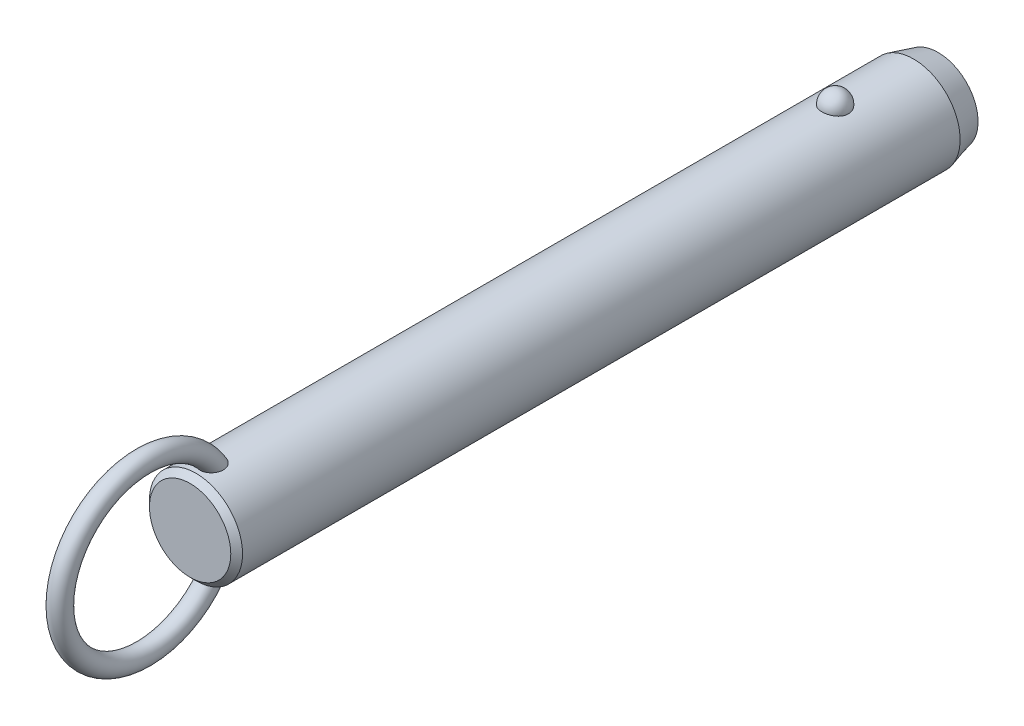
ISO-10303-21;
HEADER;
FILE_DESCRIPTION(('STEP AP214'),'2;1');
FILE_NAME('part.step','',(''),(''),'','','');
FILE_SCHEMA(('AUTOMOTIVE_DESIGN { 1 0 10303 214 1 1 1 1 }'));
ENDSEC;
DATA;
#1=APPLICATION_CONTEXT('core data for automotive mechanical design processes');
#2=APPLICATION_PROTOCOL_DEFINITION('international standard','automotive_design',2000,#1);
#3=PRODUCT_CONTEXT('',#1,'mechanical');
#4=PRODUCT('Part','Part','',(#3));
#5=PRODUCT_RELATED_PRODUCT_CATEGORY('part','',(#4));
#6=PRODUCT_DEFINITION_FORMATION('','',#4);
#7=PRODUCT_DEFINITION_CONTEXT('part definition',#1,'design');
#8=PRODUCT_DEFINITION('design','',#6,#7);
#9=PRODUCT_DEFINITION_SHAPE('','',#8);
#10=(LENGTH_UNIT() NAMED_UNIT(*) SI_UNIT(.MILLI.,.METRE.));
#11=(NAMED_UNIT(*) PLANE_ANGLE_UNIT() SI_UNIT($,.RADIAN.));
#12=(NAMED_UNIT(*) SI_UNIT($,.STERADIAN.) SOLID_ANGLE_UNIT());
#13=UNCERTAINTY_MEASURE_WITH_UNIT(LENGTH_MEASURE(1.E-05),#10,'distance_accuracy_value','');
#14=(GEOMETRIC_REPRESENTATION_CONTEXT(3) GLOBAL_UNCERTAINTY_ASSIGNED_CONTEXT((#13)) GLOBAL_UNIT_ASSIGNED_CONTEXT((#10,
#11,#12)) REPRESENTATION_CONTEXT('',''));
#15=CARTESIAN_POINT('',(0.,0.,0.));
#16=DIRECTION('',(0.,0.,1.));
#17=DIRECTION('',(1.,0.,0.));
#18=AXIS2_PLACEMENT_3D('',#15,#16,#17);
#19=CARTESIAN_POINT('',(0.,0.,119.4));
#20=DIRECTION('',(0.,0.,-1.));
#21=DIRECTION('',(-1.,0.,0.));
#22=AXIS2_PLACEMENT_3D('',#19,#20,#21);
#23=CYLINDRICAL_SURFACE('',#22,9.5);
#24=CARTESIAN_POINT('',(2.67259918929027,9.11631578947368,-2.70000000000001));
#25=CARTESIAN_POINT('',(2.6725968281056,9.11631786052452,-2.54909854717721));
#26=CARTESIAN_POINT('',(2.66030567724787,9.11994722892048,-2.39816735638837));
#27=CARTESIAN_POINT('',(2.6114347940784,9.13405924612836,-2.10058568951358));
#28=CARTESIAN_POINT('',(2.57484658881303,9.14454428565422,-1.95393672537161));
#29=CARTESIAN_POINT('',(2.47830875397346,9.17117631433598,-1.66916069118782));
#30=CARTESIAN_POINT('',(2.41836936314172,9.18732082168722,-1.53102991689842));
#31=CARTESIAN_POINT('',(2.27661331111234,9.22346780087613,-1.26705393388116));
#32=CARTESIAN_POINT('',(2.19479699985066,9.24347021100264,-1.14120852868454));
#33=CARTESIAN_POINT('',(2.01085282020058,9.28522401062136,-0.904632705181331));
#34=CARTESIAN_POINT('',(1.90862396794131,9.30698376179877,-0.793982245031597));
#35=CARTESIAN_POINT('',(1.6867437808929,9.34973971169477,-0.591607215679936));
#36=CARTESIAN_POINT('',(1.56709244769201,9.37073591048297,-0.499882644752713));
#37=CARTESIAN_POINT('',(1.31393976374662,9.40956370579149,-0.338167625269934));
#38=CARTESIAN_POINT('',(1.18048026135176,9.42740444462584,-0.268113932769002));
#39=CARTESIAN_POINT('',(0.903154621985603,9.45799906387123,-0.151390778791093));
#40=CARTESIAN_POINT('',(0.759289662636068,9.47075351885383,-0.104718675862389));
#41=CARTESIAN_POINT('',(0.468074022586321,9.48956256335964,-0.0367633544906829));
#42=CARTESIAN_POINT('',(0.320836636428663,9.49573643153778,-0.0150275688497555));
#43=CARTESIAN_POINT('',(0.0246714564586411,9.50112183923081,0.00396199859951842));
#44=CARTESIAN_POINT('',(-0.124256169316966,9.50033406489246,0.00121819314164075));
#45=CARTESIAN_POINT('',(-0.417264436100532,9.4919475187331,-0.0284441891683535));
#46=CARTESIAN_POINT('',(-0.56138413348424,9.48444885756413,-0.0550074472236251));
#47=CARTESIAN_POINT('',(-0.842986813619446,9.46357853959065,-0.131064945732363));
#48=CARTESIAN_POINT('',(-0.980469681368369,9.450206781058,-0.180559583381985));
#49=CARTESIAN_POINT('',(-1.24585005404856,9.41890822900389,-0.301476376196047));
#50=CARTESIAN_POINT('',(-1.37368611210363,9.40095498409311,-0.373026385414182));
#51=CARTESIAN_POINT('',(-1.61552738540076,9.36242964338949,-0.536025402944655));
#52=CARTESIAN_POINT('',(-1.72953116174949,9.34185727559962,-0.627476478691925));
#53=CARTESIAN_POINT('',(-1.9429225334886,9.29984568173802,-0.829844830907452));
#54=CARTESIAN_POINT('',(-2.04198021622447,9.27839736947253,-0.94110821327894));
#55=CARTESIAN_POINT('',(-2.22026460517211,9.23735994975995,-1.17883414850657));
#56=CARTESIAN_POINT('',(-2.29948985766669,9.21777097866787,-1.30529781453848));
#57=CARTESIAN_POINT('',(-2.43697287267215,9.18238994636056,-1.57158566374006));
#58=CARTESIAN_POINT('',(-2.49497068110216,9.16664569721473,-1.71155057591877));
#59=CARTESIAN_POINT('',(-2.5872073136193,9.14104303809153,-1.99961197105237));
#60=CARTESIAN_POINT('',(-2.62144683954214,9.13118445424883,-2.14770821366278));
#61=CARTESIAN_POINT('',(-2.66521466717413,9.11850622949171,-2.44715424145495));
#62=CARTESIAN_POINT('',(-2.67484831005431,9.11565658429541,-2.59848735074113));
#63=CARTESIAN_POINT('',(-2.66946735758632,9.11723375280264,-2.90067317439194));
#64=CARTESIAN_POINT('',(-2.65445345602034,9.12166036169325,-3.05152590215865));
#65=CARTESIAN_POINT('',(-2.60029711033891,9.13724422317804,-3.34766110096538));
#66=CARTESIAN_POINT('',(-2.56127978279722,9.14836656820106,-3.49296833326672));
#67=CARTESIAN_POINT('',(-2.46018844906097,9.17606676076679,-3.77477535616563));
#68=CARTESIAN_POINT('',(-2.39811349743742,9.1926448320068,-3.9112747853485));
#69=CARTESIAN_POINT('',(-2.25202303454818,9.22952198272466,-4.17244273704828));
#70=CARTESIAN_POINT('',(-2.16788714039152,9.24984129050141,-4.29704106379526));
#71=CARTESIAN_POINT('',(-1.9799408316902,9.29188255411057,-4.53013066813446));
#72=CARTESIAN_POINT('',(-1.87612963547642,9.31360456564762,-4.63862130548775));
#73=CARTESIAN_POINT('',(-1.65105429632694,9.35612959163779,-4.8369029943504));
#74=CARTESIAN_POINT('',(-1.52972405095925,9.37692871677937,-4.92661991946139));
#75=CARTESIAN_POINT('',(-1.27318250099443,9.41518970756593,-5.08429106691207));
#76=CARTESIAN_POINT('',(-1.13797219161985,9.432651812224,-5.15224684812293));
#77=CARTESIAN_POINT('',(-0.859280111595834,9.46208255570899,-5.26371827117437));
#78=CARTESIAN_POINT('',(-0.715925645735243,9.47411833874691,-5.30753421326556));
#79=CARTESIAN_POINT('',(-0.423550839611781,9.4916822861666,-5.37076321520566));
#80=CARTESIAN_POINT('',(-0.2745312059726,9.49721125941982,-5.39017930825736));
#81=CARTESIAN_POINT('',(0.0218446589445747,9.50110860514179,-5.40390587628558));
#82=CARTESIAN_POINT('',(0.16917707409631,9.49961381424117,-5.39869609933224));
#83=CARTESIAN_POINT('',(0.460808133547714,9.48993906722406,-5.36441955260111));
#84=CARTESIAN_POINT('',(0.605106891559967,9.48175936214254,-5.33535367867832));
#85=CARTESIAN_POINT('',(0.886027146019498,9.4596376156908,-5.25435587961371));
#86=CARTESIAN_POINT('',(1.02267710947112,9.44571881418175,-5.20251612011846));
#87=CARTESIAN_POINT('',(1.28523827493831,9.41358993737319,-5.07741549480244));
#88=CARTESIAN_POINT('',(1.41114877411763,9.39537958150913,-5.00415322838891));
#89=CARTESIAN_POINT('',(1.65085227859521,9.3562644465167,-4.83684599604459));
#90=CARTESIAN_POINT('',(1.76442346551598,9.33532178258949,-4.74249218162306));
#91=CARTESIAN_POINT('',(1.97425672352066,9.29321198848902,-4.53620389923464));
#92=CARTESIAN_POINT('',(2.07051582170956,9.27204482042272,-4.42426641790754));
#93=CARTESIAN_POINT('',(2.24490086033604,9.23139221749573,-4.18363183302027));
#94=CARTESIAN_POINT('',(2.32267019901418,9.21194380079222,-4.05466990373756));
#95=CARTESIAN_POINT('',(2.45584092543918,9.1773419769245,-3.78517836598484));
#96=CARTESIAN_POINT('',(2.5112497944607,9.16218713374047,-3.64465264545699));
#97=CARTESIAN_POINT('',(2.59380876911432,9.13913522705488,-3.37104301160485));
#98=CARTESIAN_POINT('',(2.62330266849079,9.13064624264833,-3.23871053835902));
#99=CARTESIAN_POINT('',(2.66269870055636,9.11923566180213,-2.97092664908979));
#100=CARTESIAN_POINT('',(2.67260130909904,9.11631393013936,-2.83547530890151));
#101=CARTESIAN_POINT('',(2.67259918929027,9.11631578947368,-2.70000000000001));
#102=B_SPLINE_CURVE_WITH_KNOTS('',3,(#24,#25,#26,#27,#28,#29,#30,#31,#32,#33,#34,#35,#36,#37,
#38,#39,#40,#41,#42,#43,#44,#45,#46,#47,#48,#49,#50,#51,#52,#53,#54,#55,#56,#57,#58,#59,#60,#61,
#62,#63,#64,#65,#66,#67,#68,#69,#70,#71,#72,#73,#74,#75,#76,#77,#78,#79,#80,#81,#82,#83,#84,#85,
#86,#87,#88,#89,#90,#91,#92,#93,#94,#95,#96,#97,#98,#99,#100,#101),.UNSPECIFIED.,.T.,.F.,(4,2,2,
2,2,2,2,2,2,2,2,2,2,2,2,2,2,2,2,2,2,2,2,2,2,2,2,2,2,2,2,2,2,2,2,2,2,2,4),(0.,0.452217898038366,
0.904593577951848,1.35677112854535,1.80894144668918,2.26340676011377,2.71787203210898,
3.17099820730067,3.62407318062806,4.0687883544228,4.51345969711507,4.95160616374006,
5.38976021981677,5.83050358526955,6.27129275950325,6.72071308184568,7.17016633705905,
7.62495278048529,8.07972578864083,8.53254856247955,8.98535859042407,9.43582813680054,
9.88631615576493,10.3393155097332,10.7923328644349,11.2471065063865,11.7018475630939,
12.150795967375,12.599688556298,13.0398725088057,13.4800399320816,13.9184421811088,
14.3568730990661,14.802202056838,15.2476074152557,15.7010097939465,16.1542603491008,
16.5602594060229,16.966248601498),.UNSPECIFIED.);
#103=CARTESIAN_POINT('',(2.67259918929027,9.11631578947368,-2.70000000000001));
#104=VERTEX_POINT('',#103);
#105=EDGE_CURVE('E41',#104,#104,#102,.T.);
#106=ORIENTED_EDGE('',*,*,#105,.T.);
#107=EDGE_LOOP('',(#106));
#108=FACE_BOUND('',#107,.T.);
#109=CARTESIAN_POINT('',(0.,0.,127.72));
#110=DIRECTION('',(0.,0.,1.));
#111=DIRECTION('',(1.,0.,0.));
#112=AXIS2_PLACEMENT_3D('',#109,#110,#111);
#113=CIRCLE('',#112,9.5);
#114=CARTESIAN_POINT('',(9.5,0.,127.72));
#115=VERTEX_POINT('',#114);
#116=EDGE_CURVE('E10',#115,#115,#113,.F.);
#117=ORIENTED_EDGE('',*,*,#116,.T.);
#118=EDGE_LOOP('',(#117));
#119=FACE_BOUND('',#118,.T.);
#120=CARTESIAN_POINT('',(-0.697062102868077,-9.47439269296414,122.067808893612));
#121=CARTESIAN_POINT('',(-0.799579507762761,-9.46685146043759,122.107482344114));
#122=CARTESIAN_POINT('',(-0.898575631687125,-9.45788043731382,122.1559309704));
#123=CARTESIAN_POINT('',(-1.08670047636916,-9.43811593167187,122.268868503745));
#124=CARTESIAN_POINT('',(-1.17583204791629,-9.42732297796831,122.333352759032));
#125=CARTESIAN_POINT('',(-1.34179806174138,-9.40513672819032,122.476209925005));
#126=CARTESIAN_POINT('',(-1.41865133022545,-9.39374438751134,122.554561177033));
#127=CARTESIAN_POINT('',(-1.5586004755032,-9.37154196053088,122.722752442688));
#128=CARTESIAN_POINT('',(-1.62169476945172,-9.3607319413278,122.81259377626));
#129=CARTESIAN_POINT('',(-1.73527695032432,-9.34035749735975,123.004500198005));
#130=CARTESIAN_POINT('',(-1.7852226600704,-9.33085270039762,123.106891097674));
#131=CARTESIAN_POINT('',(-1.86924997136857,-9.3143834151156,123.318148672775));
#132=CARTESIAN_POINT('',(-1.90332570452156,-9.30741986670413,123.427017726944));
#133=CARTESIAN_POINT('',(-1.95893603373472,-9.29588482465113,123.660473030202));
#134=CARTESIAN_POINT('',(-1.97872420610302,-9.29165182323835,123.785489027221));
#135=CARTESIAN_POINT('',(-2.00062129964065,-9.28695978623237,124.037080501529));
#136=CARTESIAN_POINT('',(-2.00272284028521,-9.28650232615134,124.163656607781));
#137=CARTESIAN_POINT('',(-1.98958876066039,-9.28932750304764,124.436815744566));
#138=CARTESIAN_POINT('',(-1.97143366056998,-9.2932400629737,124.583251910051));
#139=CARTESIAN_POINT('',(-1.91479925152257,-9.30507151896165,124.872062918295));
#140=CARTESIAN_POINT('',(-1.87629122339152,-9.31299607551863,125.014431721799));
#141=CARTESIAN_POINT('',(-1.7722568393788,-9.33340232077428,125.315172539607));
#142=CARTESIAN_POINT('',(-1.70334898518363,-9.34641636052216,125.472369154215));
#143=CARTESIAN_POINT('',(-1.58111062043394,-9.36759153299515,125.697517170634));
#144=CARTESIAN_POINT('',(-1.53721459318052,-9.37492619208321,125.770796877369));
#145=CARTESIAN_POINT('',(-1.44302631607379,-9.38988566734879,125.91307405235));
#146=CARTESIAN_POINT('',(-1.39273721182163,-9.39751033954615,125.982073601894));
#147=CARTESIAN_POINT('',(-1.26775962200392,-9.41530678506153,126.136983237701));
#148=CARTESIAN_POINT('',(-1.19052326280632,-9.42548108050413,126.220871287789));
#149=CARTESIAN_POINT('',(-1.02420241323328,-9.44499825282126,126.376008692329));
#150=CARTESIAN_POINT('',(-0.935139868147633,-9.45434261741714,126.447280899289));
#151=CARTESIAN_POINT('',(-0.766610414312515,-9.46930670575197,126.558695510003));
#152=CARTESIAN_POINT('',(-0.689439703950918,-9.47529223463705,126.602235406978));
#153=CARTESIAN_POINT('',(-0.52894200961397,-9.48560294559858,126.67631336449));
#154=CARTESIAN_POINT('',(-0.445620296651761,-9.48992953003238,126.706862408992));
#155=CARTESIAN_POINT('',(-0.27390112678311,-9.49644161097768,126.752579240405));
#156=CARTESIAN_POINT('',(-0.185465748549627,-9.49860811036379,126.76761059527));
#157=CARTESIAN_POINT('',(-0.00734541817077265,-9.5004135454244,126.780149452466));
#158=CARTESIAN_POINT('',(0.0823387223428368,-9.50005405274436,126.777667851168));
#159=CARTESIAN_POINT('',(0.247679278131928,-9.49708301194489,126.756995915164));
#160=CARTESIAN_POINT('',(0.323620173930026,-9.49477609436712,126.740930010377));
#161=CARTESIAN_POINT('',(0.471981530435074,-9.48855917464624,126.697172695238));
#162=CARTESIAN_POINT('',(0.544400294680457,-9.48464840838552,126.669475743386));
#163=CARTESIAN_POINT('',(0.708947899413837,-9.47398336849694,126.59280266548));
#164=CARTESIAN_POINT('',(0.799149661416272,-9.46671310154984,126.539774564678));
#165=CARTESIAN_POINT('',(0.969783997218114,-9.45076225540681,126.419973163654));
#166=CARTESIAN_POINT('',(1.05019415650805,-9.44207854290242,126.353169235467));
#167=CARTESIAN_POINT('',(1.23092343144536,-9.42051459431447,126.180759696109));
#168=CARTESIAN_POINT('',(1.32652499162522,-9.40733378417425,126.07026193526));
#169=CARTESIAN_POINT('',(1.49893121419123,-9.38140745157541,125.835561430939));
#170=CARTESIAN_POINT('',(1.57571616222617,-9.36866239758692,125.711344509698));
#171=CARTESIAN_POINT('',(1.71285426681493,-9.34457644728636,125.449389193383));
#172=CARTESIAN_POINT('',(1.77266365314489,-9.33328726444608,125.31136233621));
#173=CARTESIAN_POINT('',(1.87239208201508,-9.31379209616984,125.028051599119));
#174=CARTESIAN_POINT('',(1.91230158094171,-9.3055875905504,124.882764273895));
#175=CARTESIAN_POINT('',(1.9760418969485,-9.29228394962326,124.562028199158));
#176=CARTESIAN_POINT('',(1.99587438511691,-9.28797202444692,124.385724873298));
#177=CARTESIAN_POINT('',(2.0029570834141,-9.28645519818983,124.032414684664));
#178=CARTESIAN_POINT('',(1.99025930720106,-9.28923895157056,123.855409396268));
#179=CARTESIAN_POINT('',(1.93735479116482,-9.30038134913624,123.556338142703));
#180=CARTESIAN_POINT('',(1.90576827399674,-9.30697680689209,123.432667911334));
#181=CARTESIAN_POINT('',(1.82287484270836,-9.32356855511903,123.192329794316));
#182=CARTESIAN_POINT('',(1.7715821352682,-9.33356239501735,123.075656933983));
#183=CARTESIAN_POINT('',(1.64885744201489,-9.35602275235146,122.852706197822));
#184=CARTESIAN_POINT('',(1.57730995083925,-9.36850332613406,122.746492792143));
#185=CARTESIAN_POINT('',(1.41543264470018,-9.39431873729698,122.549553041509));
#186=CARTESIAN_POINT('',(1.32510883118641,-9.40765330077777,122.458821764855));
#187=CARTESIAN_POINT('',(1.13846223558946,-9.43195720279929,122.305033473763));
#188=CARTESIAN_POINT('',(1.04369890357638,-9.44302894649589,122.240094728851));
#189=CARTESIAN_POINT('',(0.843965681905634,-9.46296805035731,122.128038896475));
#190=CARTESIAN_POINT('',(0.73900000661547,-9.4718363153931,122.080914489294));
#191=CARTESIAN_POINT('',(0.528175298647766,-9.48586140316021,122.008117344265));
#192=CARTESIAN_POINT('',(0.422686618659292,-9.49119633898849,121.98140249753));
#193=CARTESIAN_POINT('',(0.208590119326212,-9.49831365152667,121.946013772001));
#194=CARTESIAN_POINT('',(0.099981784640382,-9.500095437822,121.937342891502));
#195=CARTESIAN_POINT('',(-0.126104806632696,-9.49988861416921,121.938350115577));
#196=CARTESIAN_POINT('',(-0.243578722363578,-9.49757821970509,121.949594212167));
#197=CARTESIAN_POINT('',(-0.474390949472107,-9.48885165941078,121.993167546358));
#198=CARTESIAN_POINT('',(-0.587729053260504,-9.48243528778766,122.025497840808));
#199=CARTESIAN_POINT('',(-0.697062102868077,-9.47439269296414,122.067808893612));
#200=B_SPLINE_CURVE_WITH_KNOTS('',3,(#120,#121,#122,#123,#124,#125,#126,#127,#128,#129,#130,
#131,#132,#133,#134,#135,#136,#137,#138,#139,#140,#141,#142,#143,#144,#145,#146,#147,#148,#149,
#150,#151,#152,#153,#154,#155,#156,#157,#158,#159,#160,#161,#162,#163,#164,#165,#166,#167,#168,
#169,#170,#171,#172,#173,#174,#175,#176,#177,#178,#179,#180,#181,#182,#183,#184,#185,#186,#187,
#188,#189,#190,#191,#192,#193,#194,#195,#196,#197,#198,#199),.UNSPECIFIED.,.T.,.F.,(4,2,2,2,2,2,
2,2,2,2,2,2,2,2,2,2,2,2,2,2,2,2,2,2,2,2,2,2,2,2,2,2,2,2,2,2,2,2,2,4),(0.,0.330119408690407,
0.660143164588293,0.989655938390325,1.31920659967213,1.66074728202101,2.00241415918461,
2.38088696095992,2.7595176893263,3.20065679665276,3.64242004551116,4.15620996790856,
4.41314162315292,4.66994734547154,5.01228664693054,5.3539993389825,5.61943037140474,
5.88463652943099,6.15215502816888,6.41950709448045,6.65144391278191,6.88349136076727,
7.19641200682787,7.51003602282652,7.94779711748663,8.38601491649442,8.83699707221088,
9.2881953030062,9.81778662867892,10.3465317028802,10.7284172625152,11.110028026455,
11.4938603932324,11.8775702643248,12.2220189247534,12.5663259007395,12.8915939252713,
13.2169159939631,13.5689650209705,13.9210316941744),.UNSPECIFIED.);
#201=CARTESIAN_POINT('',(-0.697062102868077,-9.47439269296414,122.067808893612));
#202=VERTEX_POINT('',#201);
#203=EDGE_CURVE('E59',#202,#202,#200,.T.);
#204=ORIENTED_EDGE('',*,*,#203,.T.);
#205=EDGE_LOOP('',(#204));
#206=FACE_BOUND('',#205,.T.);
#207=CARTESIAN_POINT('',(-0.697062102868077,9.47439269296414,122.067808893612));
#208=CARTESIAN_POINT('',(-0.597792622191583,9.48169483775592,122.02939564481));
#209=CARTESIAN_POINT('',(-0.495106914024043,9.48766580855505,121.999168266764));
#210=CARTESIAN_POINT('',(-0.285876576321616,9.49627648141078,121.956032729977));
#211=CARTESIAN_POINT('',(-0.1793245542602,9.49890941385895,121.943159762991));
#212=CARTESIAN_POINT('',(0.0344157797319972,9.50053798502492,121.935166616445));
#213=CARTESIAN_POINT('',(0.141603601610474,9.49953613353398,121.940034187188));
#214=CARTESIAN_POINT('',(0.353563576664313,9.49401038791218,121.967365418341));
#215=CARTESIAN_POINT('',(0.458336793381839,9.48948807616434,121.98982117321));
#216=CARTESIAN_POINT('',(0.662493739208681,9.4774236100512,122.051671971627));
#217=CARTESIAN_POINT('',(0.761881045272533,9.46988348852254,122.091055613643));
#218=CARTESIAN_POINT('',(0.952608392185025,9.45260382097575,122.185634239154));
#219=CARTESIAN_POINT('',(1.04394806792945,9.44286417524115,122.240829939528));
#220=CARTESIAN_POINT('',(1.21712767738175,9.4221176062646,122.366066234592));
#221=CARTESIAN_POINT('',(1.29885671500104,9.41109835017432,122.436257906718));
#222=CARTESIAN_POINT('',(1.44978975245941,9.38903310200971,122.588980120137));
#223=CARTESIAN_POINT('',(1.51899278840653,9.37798710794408,122.671511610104));
#224=CARTESIAN_POINT('',(1.64602857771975,9.35654375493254,122.849776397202));
#225=CARTESIAN_POINT('',(1.70333052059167,9.34618688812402,122.945891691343));
#226=CARTESIAN_POINT('',(1.80259341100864,9.32755128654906,123.145897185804));
#227=CARTESIAN_POINT('',(1.84454942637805,9.31927322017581,123.249789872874));
#228=CARTESIAN_POINT('',(1.91637039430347,9.30478365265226,123.472213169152));
#229=CARTESIAN_POINT('',(1.944805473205,9.29882552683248,123.591219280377));
#230=CARTESIAN_POINT('',(1.98449865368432,9.29043398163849,123.832143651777));
#231=CARTESIAN_POINT('',(1.99574908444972,9.28800213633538,123.954063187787));
#232=CARTESIAN_POINT('',(2.00275141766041,9.28649645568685,124.216932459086));
#233=CARTESIAN_POINT('',(1.99588238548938,9.28799035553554,124.357952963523));
#234=CARTESIAN_POINT('',(1.96270559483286,9.29505517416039,124.637621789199));
#235=CARTESIAN_POINT('',(1.93637872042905,9.30063010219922,124.776267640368));
#236=CARTESIAN_POINT('',(1.85949176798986,9.31633564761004,125.072561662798));
#237=CARTESIAN_POINT('',(1.80549792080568,9.3270926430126,125.229290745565));
#238=CARTESIAN_POINT('',(1.67376869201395,9.35163064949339,125.532284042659));
#239=CARTESIAN_POINT('',(1.59603181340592,9.36541185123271,125.678547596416));
#240=CARTESIAN_POINT('',(1.43602774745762,9.39110706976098,125.925813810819));
#241=CARTESIAN_POINT('',(1.3583179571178,9.40278656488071,126.029791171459));
#242=CARTESIAN_POINT('',(1.18774483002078,9.42585025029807,126.224534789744));
#243=CARTESIAN_POINT('',(1.09490932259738,9.43723493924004,126.315324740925));
#244=CARTESIAN_POINT('',(0.921110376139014,9.45552616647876,126.45620334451));
#245=CARTESIAN_POINT('',(0.843738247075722,9.46281058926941,126.510656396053));
#246=CARTESIAN_POINT('',(0.681245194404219,9.47589120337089,126.606711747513));
#247=CARTESIAN_POINT('',(0.596135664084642,9.48168953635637,126.648332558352));
#248=CARTESIAN_POINT('',(0.433779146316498,9.49038144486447,126.710089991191));
#249=CARTESIAN_POINT('',(0.357459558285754,9.49359170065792,126.73260136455));
#250=CARTESIAN_POINT('',(0.202074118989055,9.49816761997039,126.764574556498));
#251=CARTESIAN_POINT('',(0.123010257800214,9.49953459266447,126.774045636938));
#252=CARTESIAN_POINT('',(-0.0357372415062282,9.50026497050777,126.779114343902));
#253=CARTESIAN_POINT('',(-0.115421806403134,9.49962433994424,126.774684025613));
#254=CARTESIAN_POINT('',(-0.272823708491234,9.49640854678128,126.752296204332));
#255=CARTESIAN_POINT('',(-0.350540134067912,9.4938325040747,126.734332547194));
#256=CARTESIAN_POINT('',(-0.500580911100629,9.48709462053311,126.686802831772));
#257=CARTESIAN_POINT('',(-0.572979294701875,9.48296359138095,126.657461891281));
#258=CARTESIAN_POINT('',(-0.712864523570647,9.47347609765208,126.589008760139));
#259=CARTESIAN_POINT('',(-0.780349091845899,9.46811906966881,126.549892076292));
#260=CARTESIAN_POINT('',(-0.946309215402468,9.45329720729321,126.439432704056));
#261=CARTESIAN_POINT('',(-1.04090230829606,9.44321512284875,126.362329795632));
#262=CARTESIAN_POINT('',(-1.21661929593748,9.42219227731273,126.19409718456));
#263=CARTESIAN_POINT('',(-1.29770519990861,9.41124921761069,126.102929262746));
#264=CARTESIAN_POINT('',(-1.47319646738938,9.38563439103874,125.876162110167));
#265=CARTESIAN_POINT('',(-1.56208878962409,9.37102009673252,125.736289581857));
#266=CARTESIAN_POINT('',(-1.71623987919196,9.34401559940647,125.443950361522));
#267=CARTESIAN_POINT('',(-1.78147866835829,9.33162728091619,125.291473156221));
#268=CARTESIAN_POINT('',(-1.88853837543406,9.31055541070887,124.975647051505));
#269=CARTESIAN_POINT('',(-1.92998995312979,9.30193076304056,124.812168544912));
#270=CARTESIAN_POINT('',(-1.98590726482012,9.29015757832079,124.480526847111));
#271=CARTESIAN_POINT('',(-2.0004070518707,9.2870021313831,124.312369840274));
#272=CARTESIAN_POINT('',(-1.99964701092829,9.28716218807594,124.005080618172));
#273=CARTESIAN_POINT('',(-1.98908145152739,9.28945704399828,123.865936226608));
#274=CARTESIAN_POINT('',(-1.94566294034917,9.29865169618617,123.591153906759));
#275=CARTESIAN_POINT('',(-1.91282062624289,9.30554929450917,123.455514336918));
#276=CARTESIAN_POINT('',(-1.84582133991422,9.31898248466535,123.257802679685));
#277=CARTESIAN_POINT('',(-1.82038084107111,9.32400364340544,123.192583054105));
#278=CARTESIAN_POINT('',(-1.76350511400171,9.33492884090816,123.064903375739));
#279=CARTESIAN_POINT('',(-1.73207305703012,9.34083241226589,123.002441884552));
#280=CARTESIAN_POINT('',(-1.6632424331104,9.35333332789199,122.88094078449));
#281=CARTESIAN_POINT('',(-1.625842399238,9.35993084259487,122.821902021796));
#282=CARTESIAN_POINT('',(-1.54527678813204,9.37356864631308,122.707987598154));
#283=CARTESIAN_POINT('',(-1.50211241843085,9.38060884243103,122.653111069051));
#284=CARTESIAN_POINT('',(-1.37681147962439,9.40004442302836,122.509961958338));
#285=CARTESIAN_POINT('',(-1.28916358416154,9.41261047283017,122.426429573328));
#286=CARTESIAN_POINT('',(-1.09996826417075,9.43658180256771,122.277236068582));
#287=CARTESIAN_POINT('',(-0.998461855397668,9.44799034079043,122.211523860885));
#288=CARTESIAN_POINT('',(-0.860188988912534,9.46103017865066,122.1394367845));
#289=CARTESIAN_POINT('',(-0.828141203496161,9.46389141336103,122.123851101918));
#290=CARTESIAN_POINT('',(-0.76321086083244,9.46934915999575,122.094473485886));
#291=CARTESIAN_POINT('',(-0.730328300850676,9.47194567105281,122.080681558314));
#292=CARTESIAN_POINT('',(-0.697062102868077,9.47439269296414,122.067808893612));
#293=B_SPLINE_CURVE_WITH_KNOTS('',3,(#207,#208,#209,#210,#211,#212,#213,#214,#215,#216,#217,
#218,#219,#220,#221,#222,#223,#224,#225,#226,#227,#228,#229,#230,#231,#232,#233,#234,#235,#236,
#237,#238,#239,#240,#241,#242,#243,#244,#245,#246,#247,#248,#249,#250,#251,#252,#253,#254,#255,
#256,#257,#258,#259,#260,#261,#262,#263,#264,#265,#266,#267,#268,#269,#270,#271,#272,#273,#274,
#275,#276,#277,#278,#279,#280,#281,#282,#283,#284,#285,#286,#287,#288,#289,#290,#291,#292),
.UNSPECIFIED.,.T.,.F.,(4,2,2,2,2,2,2,2,2,2,2,2,2,2,2,2,2,2,2,2,2,2,2,2,2,2,2,2,2,2,2,2,2,2,2,2,
2,2,2,2,2,2,4),(0.,0.319942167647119,0.640532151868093,0.96090081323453,1.28112555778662,
1.60113495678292,1.92115886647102,2.24457323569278,2.56801248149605,2.90371927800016,
3.23953387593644,3.60560313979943,3.97183576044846,4.39383693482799,4.81625324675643,
5.31257045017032,5.80891895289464,6.19868344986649,6.5877387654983,6.87145417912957,
7.15475838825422,7.39263751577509,7.63034760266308,7.86853584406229,8.10683246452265,
8.34063661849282,8.57454843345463,8.9398393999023,9.30614105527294,9.80266668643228,
10.2996107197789,10.8040753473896,11.3079021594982,11.7249776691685,12.1418541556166,
12.3521485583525,12.5623319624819,12.7725671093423,12.9827582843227,13.345827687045,
13.7078449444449,13.8150604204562,13.9222762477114),.UNSPECIFIED.);
#294=CARTESIAN_POINT('',(-0.697062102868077,9.47439269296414,122.067808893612));
#295=VERTEX_POINT('',#294);
#296=EDGE_CURVE('E66',#295,#295,#293,.T.);
#297=ORIENTED_EDGE('',*,*,#296,.T.);
#298=EDGE_LOOP('',(#297));
#299=FACE_BOUND('',#298,.T.);
#300=CARTESIAN_POINT('',(0.,0.,-18.6999999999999));
#301=DIRECTION('',(0.,0.,-1.));
#302=DIRECTION('',(-1.,0.,0.));
#303=AXIS2_PLACEMENT_3D('',#300,#301,#302);
#304=CIRCLE('',#303,9.5);
#305=CARTESIAN_POINT('',(-9.5,0.,-18.6999999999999));
#306=VERTEX_POINT('',#305);
#307=EDGE_CURVE('E56',#306,#306,#304,.F.);
#308=ORIENTED_EDGE('',*,*,#307,.T.);
#309=EDGE_LOOP('',(#308));
#310=FACE_BOUND('',#309,.T.);
#311=ADVANCED_FACE('F37',(#108,#119,#206,#299,#310),#23,.T.);
#312=CARTESIAN_POINT('',(0.,0.,-23.7));
#313=DIRECTION('',(0.,0.,-1.));
#314=DIRECTION('',(-1.,0.,0.));
#315=AXIS2_PLACEMENT_3D('',#312,#313,#314);
#316=PLANE('',#315);
#317=CARTESIAN_POINT('',(0.,0.,-23.7));
#318=DIRECTION('',(0.,0.,-1.));
#319=DIRECTION('',(-1.,0.,0.));
#320=AXIS2_PLACEMENT_3D('',#317,#318,#319);
#321=CIRCLE('',#320,8.16025403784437);
#322=CARTESIAN_POINT('',(-8.16025403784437,0.,-23.7));
#323=VERTEX_POINT('',#322);
#324=EDGE_CURVE('E65',#323,#323,#321,.T.);
#325=ORIENTED_EDGE('',*,*,#324,.T.);
#326=EDGE_LOOP('',(#325));
#327=FACE_BOUND('',#326,.T.);
#328=ADVANCED_FACE('F84',(#327),#316,.T.);
#329=CARTESIAN_POINT('',(0.,0.,-23.7));
#330=DIRECTION('',(0.,0.,1.));
#331=DIRECTION('',(1.,0.,0.));
#332=AXIS2_PLACEMENT_3D('',#329,#330,#331);
#333=CONICAL_SURFACE('',#332,8.16025403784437,0.261799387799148);
#334=ORIENTED_EDGE('',*,*,#307,.F.);
#335=EDGE_LOOP('',(#334));
#336=FACE_BOUND('',#335,.T.);
#337=ORIENTED_EDGE('',*,*,#324,.F.);
#338=EDGE_LOOP('',(#337));
#339=FACE_BOUND('',#338,.T.);
#340=ADVANCED_FACE('F82',(#336,#339),#333,.T.);
#341=CARTESIAN_POINT('',(0.,0.,128.92));
#342=DIRECTION('',(0.,0.,1.));
#343=DIRECTION('',(1.,0.,0.));
#344=AXIS2_PLACEMENT_3D('',#341,#342,#343);
#345=PLANE('',#344);
#346=CARTESIAN_POINT('',(0.,0.,128.92));
#347=DIRECTION('',(0.,0.,1.));
#348=DIRECTION('',(1.,0.,0.));
#349=AXIS2_PLACEMENT_3D('',#346,#347,#348);
#350=CIRCLE('',#349,8.3);
#351=CARTESIAN_POINT('',(8.3,0.,128.92));
#352=VERTEX_POINT('',#351);
#353=EDGE_CURVE('E50',#352,#352,#350,.T.);
#354=ORIENTED_EDGE('',*,*,#353,.T.);
#355=EDGE_LOOP('',(#354));
#356=FACE_BOUND('',#355,.T.);
#357=ADVANCED_FACE('F76',(#356),#345,.T.);
#358=CARTESIAN_POINT('',(0.,0.,138.45));
#359=DIRECTION('',(1.,0.,0.));
#360=DIRECTION('',(0.,0.,-1.));
#361=AXIS2_PLACEMENT_3D('',#358,#359,#360);
#362=TOROIDAL_SURFACE('',#361,17.05,2.);
#363=ORIENTED_EDGE('',*,*,#296,.F.);
#364=EDGE_LOOP('',(#363));
#365=FACE_BOUND('',#364,.T.);
#366=ORIENTED_EDGE('',*,*,#203,.F.);
#367=EDGE_LOOP('',(#366));
#368=FACE_BOUND('',#367,.T.);
#369=ADVANCED_FACE('F72',(#365,#368),#362,.T.);
#370=CARTESIAN_POINT('',(0.,0.,128.92));
#371=DIRECTION('',(0.,0.,-1.));
#372=DIRECTION('',(-1.,0.,0.));
#373=AXIS2_PLACEMENT_3D('',#370,#371,#372);
#374=CONICAL_SURFACE('',#373,8.3,0.785398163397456);
#375=ORIENTED_EDGE('',*,*,#116,.F.);
#376=EDGE_LOOP('',(#375));
#377=FACE_BOUND('',#376,.T.);
#378=ORIENTED_EDGE('',*,*,#353,.F.);
#379=EDGE_LOOP('',(#378));
#380=FACE_BOUND('',#379,.T.);
#381=ADVANCED_FACE('F39',(#377,#380),#374,.T.);
#382=CARTESIAN_POINT('',(0.,9.5,-2.70000000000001));
#383=DIRECTION('',(0.,1.,0.));
#384=DIRECTION('',(0.,0.,-1.));
#385=AXIS2_PLACEMENT_3D('',#382,#383,#384);
#386=SPHERICAL_SURFACE('',#385,2.7);
#387=ORIENTED_EDGE('',*,*,#105,.F.);
#388=EDGE_LOOP('',(#387));
#389=FACE_BOUND('',#388,.T.);
#390=ADVANCED_FACE('F78',(#389),#386,.T.);
#391=CLOSED_SHELL('',(#311,#328,#340,#357,#369,#381,#390));
#392=MANIFOLD_SOLID_BREP('B2',#391);
#393=ADVANCED_BREP_SHAPE_REPRESENTATION('',(#18,#392),#14);
#394=SHAPE_DEFINITION_REPRESENTATION(#9,#393);
ENDSEC;
END-ISO-10303-21;
